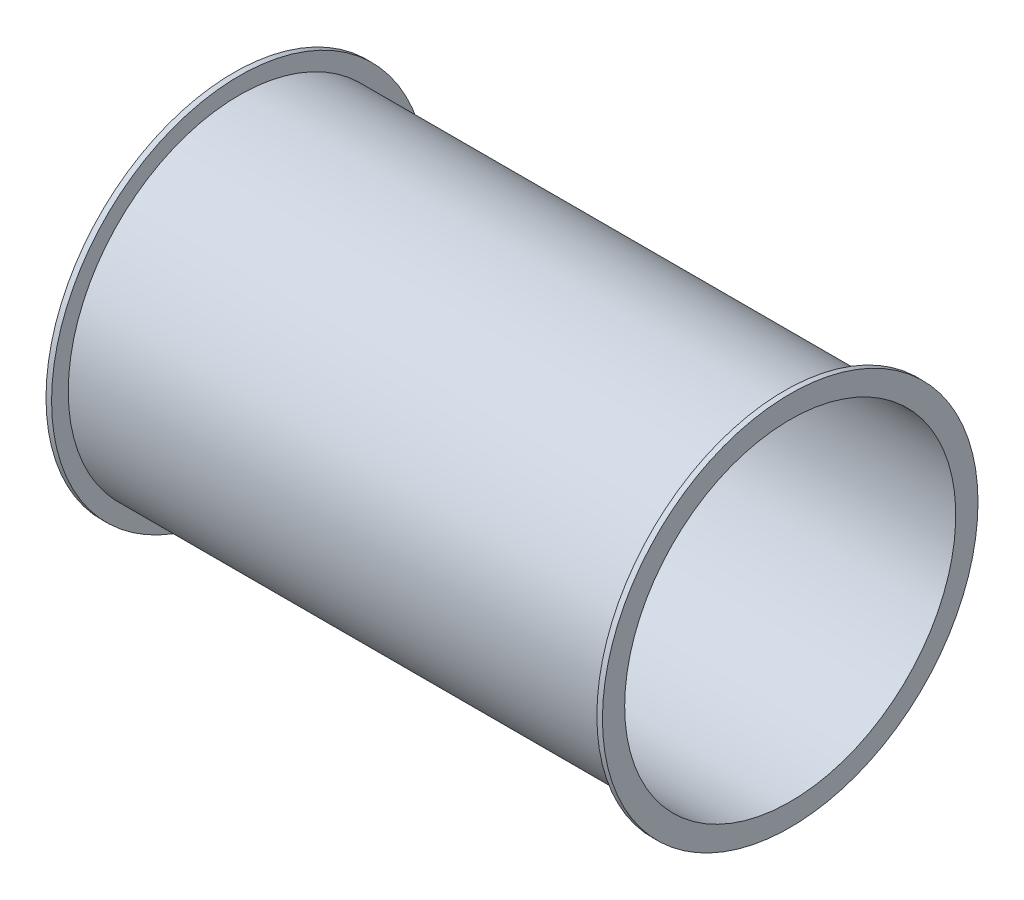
ISO-10303-21;
HEADER;
FILE_DESCRIPTION(('STEP AP214'),'2;1');
FILE_NAME('part.step','',(''),(''),'','','');
FILE_SCHEMA(('AUTOMOTIVE_DESIGN { 1 0 10303 214 1 1 1 1 }'));
ENDSEC;
DATA;
#1=APPLICATION_CONTEXT('core data for automotive mechanical design processes');
#2=APPLICATION_PROTOCOL_DEFINITION('international standard','automotive_design',2000,#1);
#3=PRODUCT_CONTEXT('',#1,'mechanical');
#4=PRODUCT('Part','Part','',(#3));
#5=PRODUCT_RELATED_PRODUCT_CATEGORY('part','',(#4));
#6=PRODUCT_DEFINITION_FORMATION('','',#4);
#7=PRODUCT_DEFINITION_CONTEXT('part definition',#1,'design');
#8=PRODUCT_DEFINITION('design','',#6,#7);
#9=PRODUCT_DEFINITION_SHAPE('','',#8);
#10=(LENGTH_UNIT() NAMED_UNIT(*) SI_UNIT(.MILLI.,.METRE.));
#11=(NAMED_UNIT(*) PLANE_ANGLE_UNIT() SI_UNIT($,.RADIAN.));
#12=(NAMED_UNIT(*) SI_UNIT($,.STERADIAN.) SOLID_ANGLE_UNIT());
#13=UNCERTAINTY_MEASURE_WITH_UNIT(LENGTH_MEASURE(1.E-05),#10,'distance_accuracy_value','');
#14=(GEOMETRIC_REPRESENTATION_CONTEXT(3) GLOBAL_UNCERTAINTY_ASSIGNED_CONTEXT((#13)) GLOBAL_UNIT_ASSIGNED_CONTEXT((#10,
#11,#12)) REPRESENTATION_CONTEXT('',''));
#15=CARTESIAN_POINT('',(0.,0.,0.));
#16=DIRECTION('',(0.,0.,1.));
#17=DIRECTION('',(1.,0.,0.));
#18=AXIS2_PLACEMENT_3D('',#15,#16,#17);
#19=CARTESIAN_POINT('',(-1176.94966826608,0.,0.));
#20=DIRECTION('',(-1.,0.,0.));
#21=DIRECTION('',(0.,0.,1.));
#22=AXIS2_PLACEMENT_3D('',#19,#20,#21);
#23=CYLINDRICAL_SURFACE('',#22,67.5);
#24=CARTESIAN_POINT('',(-993.70896713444,0.,0.));
#25=DIRECTION('',(-1.,0.,0.));
#26=DIRECTION('',(0.,0.,1.));
#27=AXIS2_PLACEMENT_3D('',#24,#25,#26);
#28=CIRCLE('',#27,67.5);
#29=CARTESIAN_POINT('',(-993.70896713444,0.,67.5));
#30=VERTEX_POINT('',#29);
#31=EDGE_CURVE('E10',#30,#30,#28,.T.);
#32=ORIENTED_EDGE('',*,*,#31,.F.);
#33=EDGE_LOOP('',(#32));
#34=FACE_BOUND('',#33,.T.);
#35=CARTESIAN_POINT('',(-991.70896713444,0.,0.));
#36=DIRECTION('',(-1.,0.,0.));
#37=DIRECTION('',(0.,0.,1.));
#38=AXIS2_PLACEMENT_3D('',#35,#36,#37);
#39=CIRCLE('',#38,67.5);
#40=CARTESIAN_POINT('',(-991.70896713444,0.,67.5));
#41=VERTEX_POINT('',#40);
#42=EDGE_CURVE('E30',#41,#41,#39,.T.);
#43=ORIENTED_EDGE('',*,*,#42,.T.);
#44=EDGE_LOOP('',(#43));
#45=FACE_BOUND('',#44,.T.);
#46=ADVANCED_FACE('F24',(#34,#45),#23,.T.);
#47=CARTESIAN_POINT('',(-991.70896713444,61.5,0.));
#48=DIRECTION('',(-1.,0.,0.));
#49=DIRECTION('',(0.,0.,1.));
#50=AXIS2_PLACEMENT_3D('',#47,#48,#49);
#51=PLANE('',#50);
#52=ORIENTED_EDGE('',*,*,#42,.F.);
#53=EDGE_LOOP('',(#52));
#54=FACE_BOUND('',#53,.T.);
#55=CARTESIAN_POINT('',(-991.70896713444,0.,0.));
#56=DIRECTION('',(-1.,0.,0.));
#57=DIRECTION('',(0.,0.,1.));
#58=AXIS2_PLACEMENT_3D('',#55,#56,#57);
#59=CIRCLE('',#58,61.5);
#60=CARTESIAN_POINT('',(-991.70896713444,0.,61.5));
#61=VERTEX_POINT('',#60);
#62=EDGE_CURVE('E34',#61,#61,#59,.T.);
#63=ORIENTED_EDGE('',*,*,#62,.T.);
#64=EDGE_LOOP('',(#63));
#65=FACE_BOUND('',#64,.T.);
#66=ADVANCED_FACE('F68',(#54,#65),#51,.F.);
#67=CARTESIAN_POINT('',(-1176.94966826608,0.,0.));
#68=DIRECTION('',(-1.,0.,0.));
#69=DIRECTION('',(0.,0.,1.));
#70=AXIS2_PLACEMENT_3D('',#67,#68,#69);
#71=CYLINDRICAL_SURFACE('',#70,61.5);
#72=ORIENTED_EDGE('',*,*,#62,.F.);
#73=EDGE_LOOP('',(#72));
#74=FACE_BOUND('',#73,.T.);
#75=CARTESIAN_POINT('',(-795.70896713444,0.,0.));
#76=DIRECTION('',(-1.,0.,0.));
#77=DIRECTION('',(0.,0.,1.));
#78=AXIS2_PLACEMENT_3D('',#75,#76,#77);
#79=CIRCLE('',#78,61.5);
#80=CARTESIAN_POINT('',(-795.70896713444,0.,61.5));
#81=VERTEX_POINT('',#80);
#82=EDGE_CURVE('E38',#81,#81,#79,.T.);
#83=ORIENTED_EDGE('',*,*,#82,.T.);
#84=EDGE_LOOP('',(#83));
#85=FACE_BOUND('',#84,.T.);
#86=ADVANCED_FACE('F73',(#74,#85),#71,.T.);
#87=CARTESIAN_POINT('',(-795.70896713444,61.5,0.));
#88=DIRECTION('',(1.,0.,0.));
#89=DIRECTION('',(0.,0.,-1.));
#90=AXIS2_PLACEMENT_3D('',#87,#88,#89);
#91=PLANE('',#90);
#92=ORIENTED_EDGE('',*,*,#82,.F.);
#93=EDGE_LOOP('',(#92));
#94=FACE_BOUND('',#93,.T.);
#95=CARTESIAN_POINT('',(-795.70896713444,0.,0.));
#96=DIRECTION('',(-1.,0.,0.));
#97=DIRECTION('',(0.,0.,1.));
#98=AXIS2_PLACEMENT_3D('',#95,#96,#97);
#99=CIRCLE('',#98,67.5000000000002);
#100=CARTESIAN_POINT('',(-795.70896713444,0.,67.5000000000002));
#101=VERTEX_POINT('',#100);
#102=EDGE_CURVE('E43',#101,#101,#99,.T.);
#103=ORIENTED_EDGE('',*,*,#102,.T.);
#104=EDGE_LOOP('',(#103));
#105=FACE_BOUND('',#104,.T.);
#106=ADVANCED_FACE('F78',(#94,#105),#91,.F.);
#107=CARTESIAN_POINT('',(-1176.94966826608,0.,0.));
#108=DIRECTION('',(-1.,0.,0.));
#109=DIRECTION('',(0.,0.,1.));
#110=AXIS2_PLACEMENT_3D('',#107,#108,#109);
#111=CYLINDRICAL_SURFACE('',#110,67.5000000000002);
#112=ORIENTED_EDGE('',*,*,#102,.F.);
#113=EDGE_LOOP('',(#112));
#114=FACE_BOUND('',#113,.T.);
#115=CARTESIAN_POINT('',(-793.70896713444,0.,0.));
#116=DIRECTION('',(-1.,0.,0.));
#117=DIRECTION('',(0.,0.,1.));
#118=AXIS2_PLACEMENT_3D('',#115,#116,#117);
#119=CIRCLE('',#118,67.5000000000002);
#120=CARTESIAN_POINT('',(-793.70896713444,0.,67.5000000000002));
#121=VERTEX_POINT('',#120);
#122=EDGE_CURVE('E46',#121,#121,#119,.T.);
#123=ORIENTED_EDGE('',*,*,#122,.T.);
#124=EDGE_LOOP('',(#123));
#125=FACE_BOUND('',#124,.T.);
#126=ADVANCED_FACE('F85',(#114,#125),#111,.T.);
#127=CARTESIAN_POINT('',(-793.70896713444,67.5000000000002,0.));
#128=DIRECTION('',(-1.,0.,0.));
#129=DIRECTION('',(0.,0.,1.));
#130=AXIS2_PLACEMENT_3D('',#127,#128,#129);
#131=PLANE('',#130);
#132=ORIENTED_EDGE('',*,*,#122,.F.);
#133=EDGE_LOOP('',(#132));
#134=FACE_BOUND('',#133,.T.);
#135=CARTESIAN_POINT('',(-793.70896713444,0.,0.));
#136=DIRECTION('',(-1.,0.,0.));
#137=DIRECTION('',(0.,0.,1.));
#138=AXIS2_PLACEMENT_3D('',#135,#136,#137);
#139=CIRCLE('',#138,59.5);
#140=CARTESIAN_POINT('',(-793.70896713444,0.,59.5));
#141=VERTEX_POINT('',#140);
#142=EDGE_CURVE('E49',#141,#141,#139,.T.);
#143=ORIENTED_EDGE('',*,*,#142,.T.);
#144=EDGE_LOOP('',(#143));
#145=FACE_BOUND('',#144,.T.);
#146=ADVANCED_FACE('F64',(#134,#145),#131,.F.);
#147=CARTESIAN_POINT('',(-1176.94966826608,0.,0.));
#148=DIRECTION('',(-1.,0.,0.));
#149=DIRECTION('',(0.,0.,1.));
#150=AXIS2_PLACEMENT_3D('',#147,#148,#149);
#151=CYLINDRICAL_SURFACE('',#150,59.5);
#152=ORIENTED_EDGE('',*,*,#142,.F.);
#153=EDGE_LOOP('',(#152));
#154=FACE_BOUND('',#153,.T.);
#155=CARTESIAN_POINT('',(-993.70896713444,0.,0.));
#156=DIRECTION('',(-1.,0.,0.));
#157=DIRECTION('',(0.,0.,1.));
#158=AXIS2_PLACEMENT_3D('',#155,#156,#157);
#159=CIRCLE('',#158,59.5);
#160=CARTESIAN_POINT('',(-993.70896713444,0.,59.5));
#161=VERTEX_POINT('',#160);
#162=EDGE_CURVE('E52',#161,#161,#159,.T.);
#163=ORIENTED_EDGE('',*,*,#162,.T.);
#164=EDGE_LOOP('',(#163));
#165=FACE_BOUND('',#164,.T.);
#166=ADVANCED_FACE('F56',(#154,#165),#151,.F.);
#167=CARTESIAN_POINT('',(-993.70896713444,61.5,0.));
#168=DIRECTION('',(1.,0.,0.));
#169=DIRECTION('',(0.,0.,-1.));
#170=AXIS2_PLACEMENT_3D('',#167,#168,#169);
#171=PLANE('',#170);
#172=ORIENTED_EDGE('',*,*,#162,.F.);
#173=EDGE_LOOP('',(#172));
#174=FACE_BOUND('',#173,.T.);
#175=ORIENTED_EDGE('',*,*,#31,.T.);
#176=EDGE_LOOP('',(#175));
#177=FACE_BOUND('',#176,.T.);
#178=ADVANCED_FACE('F58',(#174,#177),#171,.F.);
#179=CLOSED_SHELL('',(#46,#66,#86,#106,#126,#146,#166,#178));
#180=MANIFOLD_SOLID_BREP('B2',#179);
#181=ADVANCED_BREP_SHAPE_REPRESENTATION('',(#18,#180),#14);
#182=SHAPE_DEFINITION_REPRESENTATION(#9,#181);
ENDSEC;
END-ISO-10303-21;
